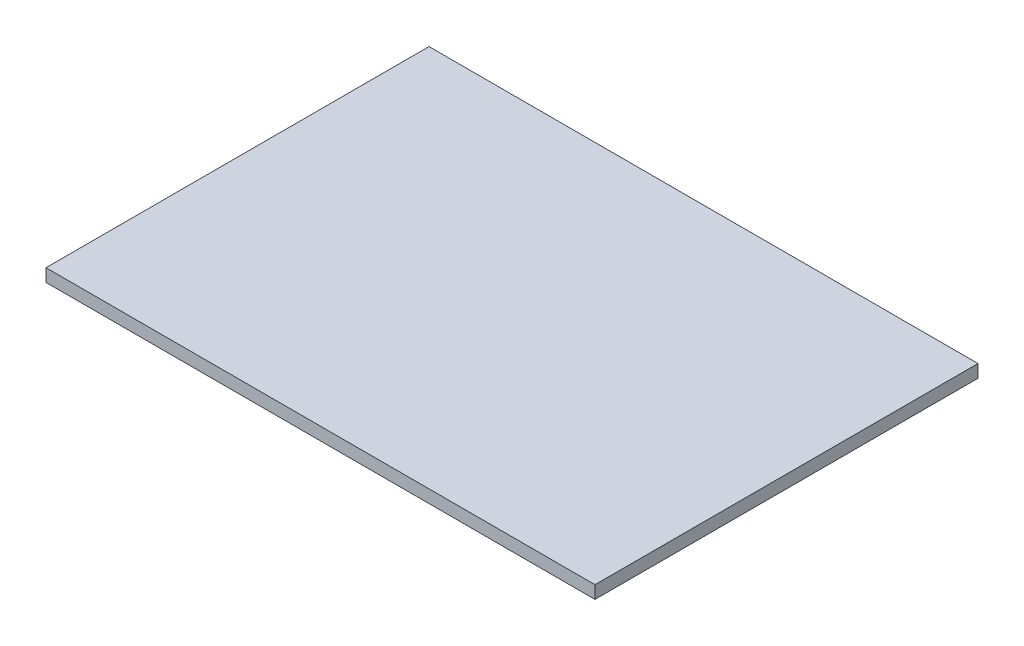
ISO-10303-21;
HEADER;
FILE_DESCRIPTION(('STEP AP214'),'2;1');
FILE_NAME('part.step','',(''),(''),'','','');
FILE_SCHEMA(('AUTOMOTIVE_DESIGN { 1 0 10303 214 1 1 1 1 }'));
ENDSEC;
DATA;
#1=APPLICATION_CONTEXT('core data for automotive mechanical design processes');
#2=APPLICATION_PROTOCOL_DEFINITION('international standard','automotive_design',2000,#1);
#3=PRODUCT_CONTEXT('',#1,'mechanical');
#4=PRODUCT('Part','Part','',(#3));
#5=PRODUCT_RELATED_PRODUCT_CATEGORY('part','',(#4));
#6=PRODUCT_DEFINITION_FORMATION('','',#4);
#7=PRODUCT_DEFINITION_CONTEXT('part definition',#1,'design');
#8=PRODUCT_DEFINITION('design','',#6,#7);
#9=PRODUCT_DEFINITION_SHAPE('','',#8);
#10=(LENGTH_UNIT() NAMED_UNIT(*) SI_UNIT(.MILLI.,.METRE.));
#11=(NAMED_UNIT(*) PLANE_ANGLE_UNIT() SI_UNIT($,.RADIAN.));
#12=(NAMED_UNIT(*) SI_UNIT($,.STERADIAN.) SOLID_ANGLE_UNIT());
#13=UNCERTAINTY_MEASURE_WITH_UNIT(LENGTH_MEASURE(1.E-05),#10,'distance_accuracy_value','');
#14=(GEOMETRIC_REPRESENTATION_CONTEXT(3) GLOBAL_UNCERTAINTY_ASSIGNED_CONTEXT((#13)) GLOBAL_UNIT_ASSIGNED_CONTEXT((#10,
#11,#12)) REPRESENTATION_CONTEXT('',''));
#15=CARTESIAN_POINT('',(0.,0.,0.));
#16=DIRECTION('',(0.,0.,1.));
#17=DIRECTION('',(1.,0.,0.));
#18=AXIS2_PLACEMENT_3D('',#15,#16,#17);
#19=CARTESIAN_POINT('',(21.5,0.5,15.));
#20=DIRECTION('',(-1.,0.,0.));
#21=DIRECTION('',(0.,0.,1.));
#22=AXIS2_PLACEMENT_3D('',#19,#20,#21);
#23=PLANE('',#22);
#24=DIRECTION('',(0.,0.,-1.));
#25=VECTOR('',#24,1.);
#26=CARTESIAN_POINT('',(21.5,-0.5,15.));
#27=LINE('',#26,#25);
#28=CARTESIAN_POINT('',(21.5,-0.5,15.));
#29=VERTEX_POINT('',#28);
#30=CARTESIAN_POINT('',(21.5,-0.5,-15.));
#31=VERTEX_POINT('',#30);
#32=EDGE_CURVE('E107',#29,#31,#27,.T.);
#33=ORIENTED_EDGE('',*,*,#32,.T.);
#34=DIRECTION('',(0.,-1.,0.));
#35=VECTOR('',#34,1.);
#36=CARTESIAN_POINT('',(21.5,0.5,-15.));
#37=LINE('',#36,#35);
#38=CARTESIAN_POINT('',(21.5,0.5,-15.));
#39=VERTEX_POINT('',#38);
#40=EDGE_CURVE('E11',#39,#31,#37,.T.);
#41=ORIENTED_EDGE('',*,*,#40,.F.);
#42=DIRECTION('',(0.,0.,-1.));
#43=VECTOR('',#42,1.);
#44=CARTESIAN_POINT('',(21.5,0.5,15.));
#45=LINE('',#44,#43);
#46=CARTESIAN_POINT('',(21.5,0.5,15.));
#47=VERTEX_POINT('',#46);
#48=EDGE_CURVE('E91',#47,#39,#45,.T.);
#49=ORIENTED_EDGE('',*,*,#48,.F.);
#50=DIRECTION('',(0.,-1.,0.));
#51=VECTOR('',#50,1.);
#52=CARTESIAN_POINT('',(21.5,0.5,15.));
#53=LINE('',#52,#51);
#54=EDGE_CURVE('E103',#47,#29,#53,.T.);
#55=ORIENTED_EDGE('',*,*,#54,.T.);
#56=EDGE_LOOP('',(#33,#41,#49,#55));
#57=FACE_BOUND('',#56,.T.);
#58=ADVANCED_FACE('F39',(#57),#23,.F.);
#59=CARTESIAN_POINT('',(-21.5,0.5,-15.));
#60=DIRECTION('',(0.,0.,1.));
#61=DIRECTION('',(1.,0.,0.));
#62=AXIS2_PLACEMENT_3D('',#59,#60,#61);
#63=PLANE('',#62);
#64=DIRECTION('',(-1.,0.,0.));
#65=VECTOR('',#64,1.);
#66=CARTESIAN_POINT('',(-21.5,-0.5,-15.));
#67=LINE('',#66,#65);
#68=CARTESIAN_POINT('',(-21.5,-0.5,-15.));
#69=VERTEX_POINT('',#68);
#70=EDGE_CURVE('E96',#31,#69,#67,.T.);
#71=ORIENTED_EDGE('',*,*,#70,.T.);
#72=DIRECTION('',(0.,-1.,0.));
#73=VECTOR('',#72,1.);
#74=CARTESIAN_POINT('',(-21.5,0.5,-15.));
#75=LINE('',#74,#73);
#76=CARTESIAN_POINT('',(-21.5,0.5,-15.));
#77=VERTEX_POINT('',#76);
#78=EDGE_CURVE('E48',#77,#69,#75,.T.);
#79=ORIENTED_EDGE('',*,*,#78,.F.);
#80=DIRECTION('',(-1.,0.,0.));
#81=VECTOR('',#80,1.);
#82=CARTESIAN_POINT('',(-21.5,0.5,-15.));
#83=LINE('',#82,#81);
#84=EDGE_CURVE('E86',#39,#77,#83,.T.);
#85=ORIENTED_EDGE('',*,*,#84,.F.);
#86=ORIENTED_EDGE('',*,*,#40,.T.);
#87=EDGE_LOOP('',(#71,#79,#85,#86));
#88=FACE_BOUND('',#87,.T.);
#89=ADVANCED_FACE('F95',(#88),#63,.F.);
#90=CARTESIAN_POINT('',(-21.5,0.5,15.));
#91=DIRECTION('',(1.,0.,0.));
#92=DIRECTION('',(0.,0.,-1.));
#93=AXIS2_PLACEMENT_3D('',#90,#91,#92);
#94=PLANE('',#93);
#95=DIRECTION('',(0.,0.,1.));
#96=VECTOR('',#95,1.);
#97=CARTESIAN_POINT('',(-21.5,-0.5,15.));
#98=LINE('',#97,#96);
#99=CARTESIAN_POINT('',(-21.5,-0.5,15.));
#100=VERTEX_POINT('',#99);
#101=EDGE_CURVE('E73',#69,#100,#98,.T.);
#102=ORIENTED_EDGE('',*,*,#101,.T.);
#103=DIRECTION('',(0.,-1.,0.));
#104=VECTOR('',#103,1.);
#105=CARTESIAN_POINT('',(-21.5,0.5,15.));
#106=LINE('',#105,#104);
#107=CARTESIAN_POINT('',(-21.5,0.5,15.));
#108=VERTEX_POINT('',#107);
#109=EDGE_CURVE('E98',#108,#100,#106,.T.);
#110=ORIENTED_EDGE('',*,*,#109,.F.);
#111=DIRECTION('',(0.,0.,1.));
#112=VECTOR('',#111,1.);
#113=CARTESIAN_POINT('',(-21.5,0.5,15.));
#114=LINE('',#113,#112);
#115=EDGE_CURVE('E89',#77,#108,#114,.T.);
#116=ORIENTED_EDGE('',*,*,#115,.F.);
#117=ORIENTED_EDGE('',*,*,#78,.T.);
#118=EDGE_LOOP('',(#102,#110,#116,#117));
#119=FACE_BOUND('',#118,.T.);
#120=ADVANCED_FACE('F99',(#119),#94,.F.);
#121=CARTESIAN_POINT('',(-21.5,0.5,15.));
#122=DIRECTION('',(0.,0.,-1.));
#123=DIRECTION('',(-1.,0.,0.));
#124=AXIS2_PLACEMENT_3D('',#121,#122,#123);
#125=PLANE('',#124);
#126=DIRECTION('',(1.,0.,0.));
#127=VECTOR('',#126,1.);
#128=CARTESIAN_POINT('',(-21.5,-0.5,15.));
#129=LINE('',#128,#127);
#130=EDGE_CURVE('E79',#100,#29,#129,.T.);
#131=ORIENTED_EDGE('',*,*,#130,.T.);
#132=ORIENTED_EDGE('',*,*,#54,.F.);
#133=DIRECTION('',(1.,0.,0.));
#134=VECTOR('',#133,1.);
#135=CARTESIAN_POINT('',(-21.5,0.5,15.));
#136=LINE('',#135,#134);
#137=EDGE_CURVE('E56',#108,#47,#136,.T.);
#138=ORIENTED_EDGE('',*,*,#137,.F.);
#139=ORIENTED_EDGE('',*,*,#109,.T.);
#140=EDGE_LOOP('',(#131,#132,#138,#139));
#141=FACE_BOUND('',#140,.T.);
#142=ADVANCED_FACE('F120',(#141),#125,.F.);
#143=CARTESIAN_POINT('',(0.,0.5,0.));
#144=DIRECTION('',(0.,-1.,0.));
#145=DIRECTION('',(0.,0.,-1.));
#146=AXIS2_PLACEMENT_3D('',#143,#144,#145);
#147=PLANE('',#146);
#148=ORIENTED_EDGE('',*,*,#48,.T.);
#149=ORIENTED_EDGE('',*,*,#84,.T.);
#150=ORIENTED_EDGE('',*,*,#115,.T.);
#151=ORIENTED_EDGE('',*,*,#137,.T.);
#152=EDGE_LOOP('',(#148,#149,#150,#151));
#153=FACE_BOUND('',#152,.T.);
#154=ADVANCED_FACE('F87',(#153),#147,.F.);
#155=CARTESIAN_POINT('',(0.,-0.5,0.));
#156=DIRECTION('',(0.,-1.,0.));
#157=DIRECTION('',(0.,0.,-1.));
#158=AXIS2_PLACEMENT_3D('',#155,#156,#157);
#159=PLANE('',#158);
#160=ORIENTED_EDGE('',*,*,#32,.F.);
#161=ORIENTED_EDGE('',*,*,#130,.F.);
#162=ORIENTED_EDGE('',*,*,#101,.F.);
#163=ORIENTED_EDGE('',*,*,#70,.F.);
#164=EDGE_LOOP('',(#160,#161,#162,#163));
#165=FACE_BOUND('',#164,.T.);
#166=ADVANCED_FACE('F123',(#165),#159,.T.);
#167=CLOSED_SHELL('',(#58,#89,#120,#142,#154,#166));
#168=MANIFOLD_SOLID_BREP('B2',#167);
#169=ADVANCED_BREP_SHAPE_REPRESENTATION('',(#18,#168),#14);
#170=SHAPE_DEFINITION_REPRESENTATION(#9,#169);
ENDSEC;
END-ISO-10303-21;
